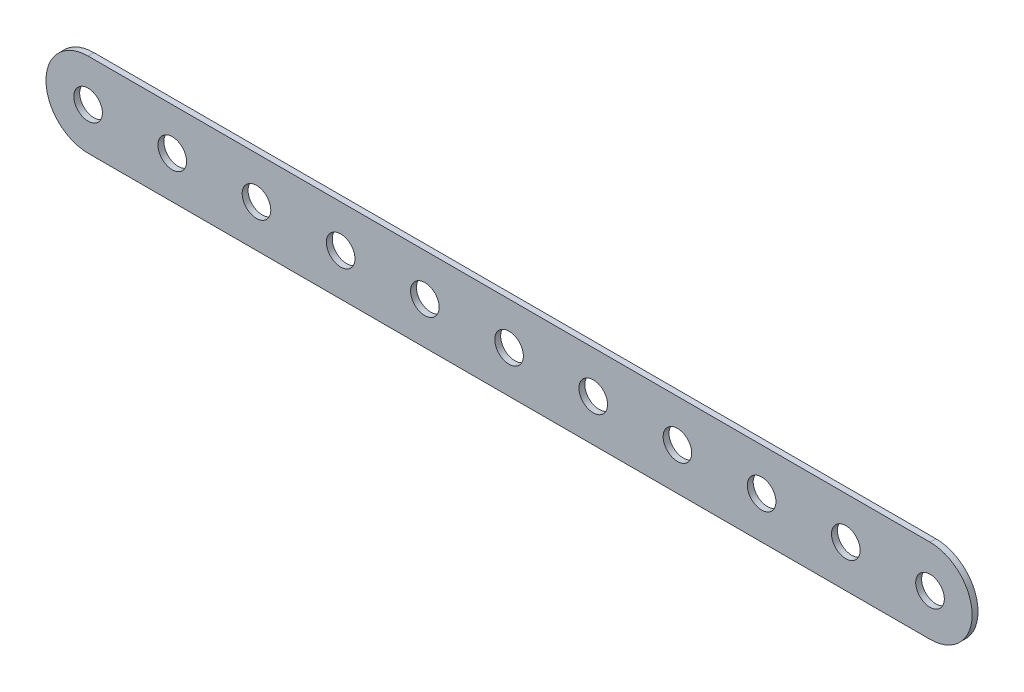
ISO-10303-21;
HEADER;
FILE_DESCRIPTION(('STEP AP214'),'2;1');
FILE_NAME('part.step','',(''),(''),'','','');
FILE_SCHEMA(('AUTOMOTIVE_DESIGN { 1 0 10303 214 1 1 1 1 }'));
ENDSEC;
DATA;
#1=APPLICATION_CONTEXT('core data for automotive mechanical design processes');
#2=APPLICATION_PROTOCOL_DEFINITION('international standard','automotive_design',2000,#1);
#3=PRODUCT_CONTEXT('',#1,'mechanical');
#4=PRODUCT('Part','Part','',(#3));
#5=PRODUCT_RELATED_PRODUCT_CATEGORY('part','',(#4));
#6=PRODUCT_DEFINITION_FORMATION('','',#4);
#7=PRODUCT_DEFINITION_CONTEXT('part definition',#1,'design');
#8=PRODUCT_DEFINITION('design','',#6,#7);
#9=PRODUCT_DEFINITION_SHAPE('','',#8);
#10=(LENGTH_UNIT() NAMED_UNIT(*) SI_UNIT(.MILLI.,.METRE.));
#11=(NAMED_UNIT(*) PLANE_ANGLE_UNIT() SI_UNIT($,.RADIAN.));
#12=(NAMED_UNIT(*) SI_UNIT($,.STERADIAN.) SOLID_ANGLE_UNIT());
#13=UNCERTAINTY_MEASURE_WITH_UNIT(LENGTH_MEASURE(1.E-05),#10,'distance_accuracy_value','');
#14=(GEOMETRIC_REPRESENTATION_CONTEXT(3) GLOBAL_UNCERTAINTY_ASSIGNED_CONTEXT((#13)) GLOBAL_UNIT_ASSIGNED_CONTEXT((#10,
#11,#12)) REPRESENTATION_CONTEXT('',''));
#15=CARTESIAN_POINT('',(0.,0.,0.));
#16=DIRECTION('',(0.,0.,1.));
#17=DIRECTION('',(1.,0.,0.));
#18=AXIS2_PLACEMENT_3D('',#15,#16,#17);
#19=CARTESIAN_POINT('',(-63.5,0.,0.889));
#20=DIRECTION('',(0.,0.,-1.));
#21=DIRECTION('',(-1.,0.,0.));
#22=AXIS2_PLACEMENT_3D('',#19,#20,#21);
#23=CYLINDRICAL_SURFACE('',#22,6.35000000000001);
#24=CARTESIAN_POINT('',(-63.5,0.,0.));
#25=DIRECTION('',(0.,0.,1.));
#26=DIRECTION('',(1.,0.,0.));
#27=AXIS2_PLACEMENT_3D('',#24,#25,#26);
#28=CIRCLE('',#27,6.35000000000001);
#29=CARTESIAN_POINT('',(-63.5,6.35000000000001,0.));
#30=VERTEX_POINT('',#29);
#31=CARTESIAN_POINT('',(-63.5,-6.35000000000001,0.));
#32=VERTEX_POINT('',#31);
#33=EDGE_CURVE('E96',#30,#32,#28,.T.);
#34=ORIENTED_EDGE('',*,*,#33,.T.);
#35=DIRECTION('',(0.,0.,-1.));
#36=VECTOR('',#35,1.);
#37=CARTESIAN_POINT('',(-63.5,-6.35000000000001,0.889));
#38=LINE('',#37,#36);
#39=CARTESIAN_POINT('',(-63.5,-6.35000000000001,0.889));
#40=VERTEX_POINT('',#39);
#41=EDGE_CURVE('E11',#40,#32,#38,.T.);
#42=ORIENTED_EDGE('',*,*,#41,.F.);
#43=CARTESIAN_POINT('',(-63.5,0.,0.889));
#44=DIRECTION('',(0.,0.,1.));
#45=DIRECTION('',(1.,0.,0.));
#46=AXIS2_PLACEMENT_3D('',#43,#44,#45);
#47=CIRCLE('',#46,6.35000000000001);
#48=CARTESIAN_POINT('',(-63.5,6.35000000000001,0.889));
#49=VERTEX_POINT('',#48);
#50=EDGE_CURVE('E84',#49,#40,#47,.T.);
#51=ORIENTED_EDGE('',*,*,#50,.F.);
#52=DIRECTION('',(0.,0.,-1.));
#53=VECTOR('',#52,1.);
#54=CARTESIAN_POINT('',(-63.5,6.35000000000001,0.889));
#55=LINE('',#54,#53);
#56=EDGE_CURVE('E92',#49,#30,#55,.T.);
#57=ORIENTED_EDGE('',*,*,#56,.T.);
#58=EDGE_LOOP('',(#34,#42,#51,#57));
#59=FACE_BOUND('',#58,.T.);
#60=ADVANCED_FACE('F33',(#59),#23,.T.);
#61=CARTESIAN_POINT('',(-63.5,-6.35000000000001,0.889));
#62=DIRECTION('',(0.,1.,0.));
#63=DIRECTION('',(0.,0.,1.));
#64=AXIS2_PLACEMENT_3D('',#61,#62,#63);
#65=PLANE('',#64);
#66=DIRECTION('',(1.,0.,0.));
#67=VECTOR('',#66,1.);
#68=CARTESIAN_POINT('',(-63.5,-6.35000000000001,0.));
#69=LINE('',#68,#67);
#70=CARTESIAN_POINT('',(63.5,-6.35,0.));
#71=VERTEX_POINT('',#70);
#72=EDGE_CURVE('E88',#32,#71,#69,.T.);
#73=ORIENTED_EDGE('',*,*,#72,.T.);
#74=DIRECTION('',(0.,0.,-1.));
#75=VECTOR('',#74,1.);
#76=CARTESIAN_POINT('',(63.5,-6.35,0.889));
#77=LINE('',#76,#75);
#78=CARTESIAN_POINT('',(63.5,-6.35,0.889));
#79=VERTEX_POINT('',#78);
#80=EDGE_CURVE('E41',#79,#71,#77,.T.);
#81=ORIENTED_EDGE('',*,*,#80,.F.);
#82=DIRECTION('',(1.,0.,0.));
#83=VECTOR('',#82,1.);
#84=CARTESIAN_POINT('',(-63.5,-6.35000000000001,0.889));
#85=LINE('',#84,#83);
#86=EDGE_CURVE('E79',#40,#79,#85,.T.);
#87=ORIENTED_EDGE('',*,*,#86,.F.);
#88=ORIENTED_EDGE('',*,*,#41,.T.);
#89=EDGE_LOOP('',(#73,#81,#87,#88));
#90=FACE_BOUND('',#89,.T.);
#91=ADVANCED_FACE('F87',(#90),#65,.F.);
#92=CARTESIAN_POINT('',(63.5,0.,0.889));
#93=DIRECTION('',(0.,0.,-1.));
#94=DIRECTION('',(-1.,0.,0.));
#95=AXIS2_PLACEMENT_3D('',#92,#93,#94);
#96=CYLINDRICAL_SURFACE('',#95,6.35000000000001);
#97=CARTESIAN_POINT('',(63.5,0.,0.));
#98=DIRECTION('',(0.,0.,1.));
#99=DIRECTION('',(1.,0.,0.));
#100=AXIS2_PLACEMENT_3D('',#97,#98,#99);
#101=CIRCLE('',#100,6.35000000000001);
#102=CARTESIAN_POINT('',(63.5,6.35000000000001,0.));
#103=VERTEX_POINT('',#102);
#104=EDGE_CURVE('E66',#71,#103,#101,.T.);
#105=ORIENTED_EDGE('',*,*,#104,.T.);
#106=DIRECTION('',(0.,0.,-1.));
#107=VECTOR('',#106,1.);
#108=CARTESIAN_POINT('',(63.5,6.35000000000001,0.889));
#109=LINE('',#108,#107);
#110=CARTESIAN_POINT('',(63.5,6.35000000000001,0.889));
#111=VERTEX_POINT('',#110);
#112=EDGE_CURVE('E89',#111,#103,#109,.T.);
#113=ORIENTED_EDGE('',*,*,#112,.F.);
#114=CARTESIAN_POINT('',(63.5,0.,0.889));
#115=DIRECTION('',(0.,0.,1.));
#116=DIRECTION('',(1.,0.,0.));
#117=AXIS2_PLACEMENT_3D('',#114,#115,#116);
#118=CIRCLE('',#117,6.35000000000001);
#119=EDGE_CURVE('E82',#79,#111,#118,.T.);
#120=ORIENTED_EDGE('',*,*,#119,.F.);
#121=ORIENTED_EDGE('',*,*,#80,.T.);
#122=EDGE_LOOP('',(#105,#113,#120,#121));
#123=FACE_BOUND('',#122,.T.);
#124=ADVANCED_FACE('F90',(#123),#96,.T.);
#125=CARTESIAN_POINT('',(-63.5,6.35000000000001,0.889));
#126=DIRECTION('',(0.,-1.,0.));
#127=DIRECTION('',(0.,0.,-1.));
#128=AXIS2_PLACEMENT_3D('',#125,#126,#127);
#129=PLANE('',#128);
#130=DIRECTION('',(-1.,0.,0.));
#131=VECTOR('',#130,1.);
#132=CARTESIAN_POINT('',(-63.5,6.35000000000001,0.));
#133=LINE('',#132,#131);
#134=EDGE_CURVE('E72',#103,#30,#133,.T.);
#135=ORIENTED_EDGE('',*,*,#134,.T.);
#136=ORIENTED_EDGE('',*,*,#56,.F.);
#137=DIRECTION('',(-1.,0.,0.));
#138=VECTOR('',#137,1.);
#139=CARTESIAN_POINT('',(-63.5,6.35000000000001,0.889));
#140=LINE('',#139,#138);
#141=EDGE_CURVE('E49',#111,#49,#140,.T.);
#142=ORIENTED_EDGE('',*,*,#141,.F.);
#143=ORIENTED_EDGE('',*,*,#112,.T.);
#144=EDGE_LOOP('',(#135,#136,#142,#143));
#145=FACE_BOUND('',#144,.T.);
#146=ADVANCED_FACE('F104',(#145),#129,.F.);
#147=CARTESIAN_POINT('',(-63.5,0.,0.889));
#148=DIRECTION('',(0.,0.,1.));
#149=DIRECTION('',(1.,0.,0.));
#150=AXIS2_PLACEMENT_3D('',#147,#148,#149);
#151=PLANE('',#150);
#152=CARTESIAN_POINT('',(-63.5,0.,0.889));
#153=DIRECTION('',(0.,0.,1.));
#154=DIRECTION('',(1.,0.,0.));
#155=AXIS2_PLACEMENT_3D('',#152,#153,#154);
#156=CIRCLE('',#155,2.159);
#157=CARTESIAN_POINT('',(-61.341,0.,0.889));
#158=VERTEX_POINT('',#157);
#159=EDGE_CURVE('E170',#158,#158,#156,.T.);
#160=ORIENTED_EDGE('',*,*,#159,.F.);
#161=EDGE_LOOP('',(#160));
#162=FACE_BOUND('',#161,.T.);
#163=CARTESIAN_POINT('',(-50.8,0.,0.889));
#164=DIRECTION('',(0.,0.,1.));
#165=DIRECTION('',(1.,0.,0.));
#166=AXIS2_PLACEMENT_3D('',#163,#164,#165);
#167=CIRCLE('',#166,2.15899999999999);
#168=CARTESIAN_POINT('',(-48.641,0.,0.889));
#169=VERTEX_POINT('',#168);
#170=EDGE_CURVE('E164',#169,#169,#167,.T.);
#171=ORIENTED_EDGE('',*,*,#170,.F.);
#172=EDGE_LOOP('',(#171));
#173=FACE_BOUND('',#172,.T.);
#174=CARTESIAN_POINT('',(-38.1,0.,0.889));
#175=DIRECTION('',(0.,0.,1.));
#176=DIRECTION('',(1.,0.,0.));
#177=AXIS2_PLACEMENT_3D('',#174,#175,#176);
#178=CIRCLE('',#177,2.159);
#179=CARTESIAN_POINT('',(-35.941,0.,0.889));
#180=VERTEX_POINT('',#179);
#181=EDGE_CURVE('E158',#180,#180,#178,.T.);
#182=ORIENTED_EDGE('',*,*,#181,.F.);
#183=EDGE_LOOP('',(#182));
#184=FACE_BOUND('',#183,.T.);
#185=CARTESIAN_POINT('',(-25.4,0.,0.889));
#186=DIRECTION('',(0.,0.,1.));
#187=DIRECTION('',(1.,0.,0.));
#188=AXIS2_PLACEMENT_3D('',#185,#186,#187);
#189=CIRCLE('',#188,2.159);
#190=CARTESIAN_POINT('',(-23.241,0.,0.889));
#191=VERTEX_POINT('',#190);
#192=EDGE_CURVE('E152',#191,#191,#189,.T.);
#193=ORIENTED_EDGE('',*,*,#192,.F.);
#194=EDGE_LOOP('',(#193));
#195=FACE_BOUND('',#194,.T.);
#196=CARTESIAN_POINT('',(-12.7,0.,0.889));
#197=DIRECTION('',(0.,0.,1.));
#198=DIRECTION('',(1.,0.,0.));
#199=AXIS2_PLACEMENT_3D('',#196,#197,#198);
#200=CIRCLE('',#199,2.159);
#201=CARTESIAN_POINT('',(-10.541,0.,0.889));
#202=VERTEX_POINT('',#201);
#203=EDGE_CURVE('E146',#202,#202,#200,.T.);
#204=ORIENTED_EDGE('',*,*,#203,.F.);
#205=EDGE_LOOP('',(#204));
#206=FACE_BOUND('',#205,.T.);
#207=CARTESIAN_POINT('',(0.,0.,0.889));
#208=DIRECTION('',(0.,0.,1.));
#209=DIRECTION('',(1.,0.,0.));
#210=AXIS2_PLACEMENT_3D('',#207,#208,#209);
#211=CIRCLE('',#210,2.159);
#212=CARTESIAN_POINT('',(2.159,0.,0.889));
#213=VERTEX_POINT('',#212);
#214=EDGE_CURVE('E140',#213,#213,#211,.T.);
#215=ORIENTED_EDGE('',*,*,#214,.F.);
#216=EDGE_LOOP('',(#215));
#217=FACE_BOUND('',#216,.T.);
#218=CARTESIAN_POINT('',(12.7,0.,0.889));
#219=DIRECTION('',(0.,0.,1.));
#220=DIRECTION('',(1.,0.,0.));
#221=AXIS2_PLACEMENT_3D('',#218,#219,#220);
#222=CIRCLE('',#221,2.159);
#223=CARTESIAN_POINT('',(14.859,0.,0.889));
#224=VERTEX_POINT('',#223);
#225=EDGE_CURVE('E134',#224,#224,#222,.T.);
#226=ORIENTED_EDGE('',*,*,#225,.F.);
#227=EDGE_LOOP('',(#226));
#228=FACE_BOUND('',#227,.T.);
#229=CARTESIAN_POINT('',(25.4,0.,0.889));
#230=DIRECTION('',(0.,0.,1.));
#231=DIRECTION('',(1.,0.,0.));
#232=AXIS2_PLACEMENT_3D('',#229,#230,#231);
#233=CIRCLE('',#232,2.159);
#234=CARTESIAN_POINT('',(27.559,0.,0.889));
#235=VERTEX_POINT('',#234);
#236=EDGE_CURVE('E128',#235,#235,#233,.T.);
#237=ORIENTED_EDGE('',*,*,#236,.F.);
#238=EDGE_LOOP('',(#237));
#239=FACE_BOUND('',#238,.T.);
#240=CARTESIAN_POINT('',(38.1,0.,0.889));
#241=DIRECTION('',(0.,0.,1.));
#242=DIRECTION('',(1.,0.,0.));
#243=AXIS2_PLACEMENT_3D('',#240,#241,#242);
#244=CIRCLE('',#243,2.159);
#245=CARTESIAN_POINT('',(40.259,0.,0.889));
#246=VERTEX_POINT('',#245);
#247=EDGE_CURVE('E122',#246,#246,#244,.T.);
#248=ORIENTED_EDGE('',*,*,#247,.F.);
#249=EDGE_LOOP('',(#248));
#250=FACE_BOUND('',#249,.T.);
#251=CARTESIAN_POINT('',(50.8,0.,0.889));
#252=DIRECTION('',(0.,0.,1.));
#253=DIRECTION('',(1.,0.,0.));
#254=AXIS2_PLACEMENT_3D('',#251,#252,#253);
#255=CIRCLE('',#254,2.159);
#256=CARTESIAN_POINT('',(52.959,0.,0.889));
#257=VERTEX_POINT('',#256);
#258=EDGE_CURVE('E116',#257,#257,#255,.T.);
#259=ORIENTED_EDGE('',*,*,#258,.F.);
#260=EDGE_LOOP('',(#259));
#261=FACE_BOUND('',#260,.T.);
#262=CARTESIAN_POINT('',(63.5,0.,0.889));
#263=DIRECTION('',(0.,0.,1.));
#264=DIRECTION('',(1.,0.,0.));
#265=AXIS2_PLACEMENT_3D('',#262,#263,#264);
#266=CIRCLE('',#265,2.15899999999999);
#267=CARTESIAN_POINT('',(65.659,0.,0.889));
#268=VERTEX_POINT('',#267);
#269=EDGE_CURVE('E110',#268,#268,#266,.T.);
#270=ORIENTED_EDGE('',*,*,#269,.F.);
#271=EDGE_LOOP('',(#270));
#272=FACE_BOUND('',#271,.T.);
#273=ORIENTED_EDGE('',*,*,#50,.T.);
#274=ORIENTED_EDGE('',*,*,#86,.T.);
#275=ORIENTED_EDGE('',*,*,#119,.T.);
#276=ORIENTED_EDGE('',*,*,#141,.T.);
#277=EDGE_LOOP('',(#273,#274,#275,#276));
#278=FACE_BOUND('',#277,.T.);
#279=ADVANCED_FACE('F80',(#162,#173,#184,#195,#206,#217,#228,#239,#250,#261,#272,#278),#151,.T.);
#280=CARTESIAN_POINT('',(-63.5,0.,0.));
#281=DIRECTION('',(0.,0.,1.));
#282=DIRECTION('',(1.,0.,0.));
#283=AXIS2_PLACEMENT_3D('',#280,#281,#282);
#284=PLANE('',#283);
#285=CARTESIAN_POINT('',(-63.5,0.,0.));
#286=DIRECTION('',(0.,0.,1.));
#287=DIRECTION('',(1.,0.,0.));
#288=AXIS2_PLACEMENT_3D('',#285,#286,#287);
#289=CIRCLE('',#288,2.159);
#290=CARTESIAN_POINT('',(-61.341,0.,0.));
#291=VERTEX_POINT('',#290);
#292=EDGE_CURVE('E99',#291,#291,#289,.T.);
#293=ORIENTED_EDGE('',*,*,#292,.T.);
#294=EDGE_LOOP('',(#293));
#295=FACE_BOUND('',#294,.T.);
#296=CARTESIAN_POINT('',(-50.8,0.,0.));
#297=DIRECTION('',(0.,0.,1.));
#298=DIRECTION('',(1.,0.,0.));
#299=AXIS2_PLACEMENT_3D('',#296,#297,#298);
#300=CIRCLE('',#299,2.15899999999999);
#301=CARTESIAN_POINT('',(-48.641,0.,0.));
#302=VERTEX_POINT('',#301);
#303=EDGE_CURVE('E167',#302,#302,#300,.T.);
#304=ORIENTED_EDGE('',*,*,#303,.T.);
#305=EDGE_LOOP('',(#304));
#306=FACE_BOUND('',#305,.T.);
#307=CARTESIAN_POINT('',(-38.1,0.,0.));
#308=DIRECTION('',(0.,0.,1.));
#309=DIRECTION('',(1.,0.,0.));
#310=AXIS2_PLACEMENT_3D('',#307,#308,#309);
#311=CIRCLE('',#310,2.159);
#312=CARTESIAN_POINT('',(-35.941,0.,0.));
#313=VERTEX_POINT('',#312);
#314=EDGE_CURVE('E161',#313,#313,#311,.T.);
#315=ORIENTED_EDGE('',*,*,#314,.T.);
#316=EDGE_LOOP('',(#315));
#317=FACE_BOUND('',#316,.T.);
#318=CARTESIAN_POINT('',(-25.4,0.,0.));
#319=DIRECTION('',(0.,0.,1.));
#320=DIRECTION('',(1.,0.,0.));
#321=AXIS2_PLACEMENT_3D('',#318,#319,#320);
#322=CIRCLE('',#321,2.159);
#323=CARTESIAN_POINT('',(-23.241,0.,0.));
#324=VERTEX_POINT('',#323);
#325=EDGE_CURVE('E155',#324,#324,#322,.T.);
#326=ORIENTED_EDGE('',*,*,#325,.T.);
#327=EDGE_LOOP('',(#326));
#328=FACE_BOUND('',#327,.T.);
#329=CARTESIAN_POINT('',(-12.7,0.,0.));
#330=DIRECTION('',(0.,0.,1.));
#331=DIRECTION('',(1.,0.,0.));
#332=AXIS2_PLACEMENT_3D('',#329,#330,#331);
#333=CIRCLE('',#332,2.159);
#334=CARTESIAN_POINT('',(-10.541,0.,0.));
#335=VERTEX_POINT('',#334);
#336=EDGE_CURVE('E149',#335,#335,#333,.T.);
#337=ORIENTED_EDGE('',*,*,#336,.T.);
#338=EDGE_LOOP('',(#337));
#339=FACE_BOUND('',#338,.T.);
#340=CARTESIAN_POINT('',(0.,0.,0.));
#341=DIRECTION('',(0.,0.,1.));
#342=DIRECTION('',(1.,0.,0.));
#343=AXIS2_PLACEMENT_3D('',#340,#341,#342);
#344=CIRCLE('',#343,2.159);
#345=CARTESIAN_POINT('',(2.159,0.,0.));
#346=VERTEX_POINT('',#345);
#347=EDGE_CURVE('E143',#346,#346,#344,.T.);
#348=ORIENTED_EDGE('',*,*,#347,.T.);
#349=EDGE_LOOP('',(#348));
#350=FACE_BOUND('',#349,.T.);
#351=CARTESIAN_POINT('',(12.7,0.,0.));
#352=DIRECTION('',(0.,0.,1.));
#353=DIRECTION('',(1.,0.,0.));
#354=AXIS2_PLACEMENT_3D('',#351,#352,#353);
#355=CIRCLE('',#354,2.159);
#356=CARTESIAN_POINT('',(14.859,0.,0.));
#357=VERTEX_POINT('',#356);
#358=EDGE_CURVE('E137',#357,#357,#355,.T.);
#359=ORIENTED_EDGE('',*,*,#358,.T.);
#360=EDGE_LOOP('',(#359));
#361=FACE_BOUND('',#360,.T.);
#362=CARTESIAN_POINT('',(25.4,0.,0.));
#363=DIRECTION('',(0.,0.,1.));
#364=DIRECTION('',(1.,0.,0.));
#365=AXIS2_PLACEMENT_3D('',#362,#363,#364);
#366=CIRCLE('',#365,2.159);
#367=CARTESIAN_POINT('',(27.559,0.,0.));
#368=VERTEX_POINT('',#367);
#369=EDGE_CURVE('E131',#368,#368,#366,.T.);
#370=ORIENTED_EDGE('',*,*,#369,.T.);
#371=EDGE_LOOP('',(#370));
#372=FACE_BOUND('',#371,.T.);
#373=CARTESIAN_POINT('',(38.1,0.,0.));
#374=DIRECTION('',(0.,0.,1.));
#375=DIRECTION('',(1.,0.,0.));
#376=AXIS2_PLACEMENT_3D('',#373,#374,#375);
#377=CIRCLE('',#376,2.159);
#378=CARTESIAN_POINT('',(40.259,0.,0.));
#379=VERTEX_POINT('',#378);
#380=EDGE_CURVE('E125',#379,#379,#377,.T.);
#381=ORIENTED_EDGE('',*,*,#380,.T.);
#382=EDGE_LOOP('',(#381));
#383=FACE_BOUND('',#382,.T.);
#384=CARTESIAN_POINT('',(50.8,0.,0.));
#385=DIRECTION('',(0.,0.,1.));
#386=DIRECTION('',(1.,0.,0.));
#387=AXIS2_PLACEMENT_3D('',#384,#385,#386);
#388=CIRCLE('',#387,2.159);
#389=CARTESIAN_POINT('',(52.959,0.,0.));
#390=VERTEX_POINT('',#389);
#391=EDGE_CURVE('E119',#390,#390,#388,.T.);
#392=ORIENTED_EDGE('',*,*,#391,.T.);
#393=EDGE_LOOP('',(#392));
#394=FACE_BOUND('',#393,.T.);
#395=CARTESIAN_POINT('',(63.5,0.,0.));
#396=DIRECTION('',(0.,0.,1.));
#397=DIRECTION('',(1.,0.,0.));
#398=AXIS2_PLACEMENT_3D('',#395,#396,#397);
#399=CIRCLE('',#398,2.15899999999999);
#400=CARTESIAN_POINT('',(65.659,0.,0.));
#401=VERTEX_POINT('',#400);
#402=EDGE_CURVE('E113',#401,#401,#399,.T.);
#403=ORIENTED_EDGE('',*,*,#402,.T.);
#404=EDGE_LOOP('',(#403));
#405=FACE_BOUND('',#404,.T.);
#406=ORIENTED_EDGE('',*,*,#33,.F.);
#407=ORIENTED_EDGE('',*,*,#134,.F.);
#408=ORIENTED_EDGE('',*,*,#104,.F.);
#409=ORIENTED_EDGE('',*,*,#72,.F.);
#410=EDGE_LOOP('',(#406,#407,#408,#409));
#411=FACE_BOUND('',#410,.T.);
#412=ADVANCED_FACE('F107',(#295,#306,#317,#328,#339,#350,#361,#372,#383,#394,#405,#411),#284,.F.);
#413=CARTESIAN_POINT('',(63.5,0.,0.));
#414=DIRECTION('',(0.,0.,1.));
#415=DIRECTION('',(1.,0.,0.));
#416=AXIS2_PLACEMENT_3D('',#413,#414,#415);
#417=CYLINDRICAL_SURFACE('',#416,2.15899999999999);
#418=ORIENTED_EDGE('',*,*,#402,.F.);
#419=EDGE_LOOP('',(#418));
#420=FACE_BOUND('',#419,.T.);
#421=ORIENTED_EDGE('',*,*,#269,.T.);
#422=EDGE_LOOP('',(#421));
#423=FACE_BOUND('',#422,.T.);
#424=ADVANCED_FACE('F208',(#420,#423),#417,.F.);
#425=CARTESIAN_POINT('',(50.8,0.,0.));
#426=DIRECTION('',(0.,0.,1.));
#427=DIRECTION('',(1.,0.,0.));
#428=AXIS2_PLACEMENT_3D('',#425,#426,#427);
#429=CYLINDRICAL_SURFACE('',#428,2.159);
#430=ORIENTED_EDGE('',*,*,#391,.F.);
#431=EDGE_LOOP('',(#430));
#432=FACE_BOUND('',#431,.T.);
#433=ORIENTED_EDGE('',*,*,#258,.T.);
#434=EDGE_LOOP('',(#433));
#435=FACE_BOUND('',#434,.T.);
#436=ADVANCED_FACE('F210',(#432,#435),#429,.F.);
#437=CARTESIAN_POINT('',(38.1,0.,0.));
#438=DIRECTION('',(0.,0.,1.));
#439=DIRECTION('',(1.,0.,0.));
#440=AXIS2_PLACEMENT_3D('',#437,#438,#439);
#441=CYLINDRICAL_SURFACE('',#440,2.159);
#442=ORIENTED_EDGE('',*,*,#380,.F.);
#443=EDGE_LOOP('',(#442));
#444=FACE_BOUND('',#443,.T.);
#445=ORIENTED_EDGE('',*,*,#247,.T.);
#446=EDGE_LOOP('',(#445));
#447=FACE_BOUND('',#446,.T.);
#448=ADVANCED_FACE('F217',(#444,#447),#441,.F.);
#449=CARTESIAN_POINT('',(25.4,0.,0.));
#450=DIRECTION('',(0.,0.,1.));
#451=DIRECTION('',(1.,0.,0.));
#452=AXIS2_PLACEMENT_3D('',#449,#450,#451);
#453=CYLINDRICAL_SURFACE('',#452,2.159);
#454=ORIENTED_EDGE('',*,*,#369,.F.);
#455=EDGE_LOOP('',(#454));
#456=FACE_BOUND('',#455,.T.);
#457=ORIENTED_EDGE('',*,*,#236,.T.);
#458=EDGE_LOOP('',(#457));
#459=FACE_BOUND('',#458,.T.);
#460=ADVANCED_FACE('F263',(#456,#459),#453,.F.);
#461=CARTESIAN_POINT('',(12.7,0.,0.));
#462=DIRECTION('',(0.,0.,1.));
#463=DIRECTION('',(1.,0.,0.));
#464=AXIS2_PLACEMENT_3D('',#461,#462,#463);
#465=CYLINDRICAL_SURFACE('',#464,2.159);
#466=ORIENTED_EDGE('',*,*,#358,.F.);
#467=EDGE_LOOP('',(#466));
#468=FACE_BOUND('',#467,.T.);
#469=ORIENTED_EDGE('',*,*,#225,.T.);
#470=EDGE_LOOP('',(#469));
#471=FACE_BOUND('',#470,.T.);
#472=ADVANCED_FACE('F273',(#468,#471),#465,.F.);
#473=CARTESIAN_POINT('',(0.,0.,0.));
#474=DIRECTION('',(0.,0.,1.));
#475=DIRECTION('',(1.,0.,0.));
#476=AXIS2_PLACEMENT_3D('',#473,#474,#475);
#477=CYLINDRICAL_SURFACE('',#476,2.159);
#478=ORIENTED_EDGE('',*,*,#347,.F.);
#479=EDGE_LOOP('',(#478));
#480=FACE_BOUND('',#479,.T.);
#481=ORIENTED_EDGE('',*,*,#214,.T.);
#482=EDGE_LOOP('',(#481));
#483=FACE_BOUND('',#482,.T.);
#484=ADVANCED_FACE('F283',(#480,#483),#477,.F.);
#485=CARTESIAN_POINT('',(-12.7,0.,0.));
#486=DIRECTION('',(0.,0.,1.));
#487=DIRECTION('',(1.,0.,0.));
#488=AXIS2_PLACEMENT_3D('',#485,#486,#487);
#489=CYLINDRICAL_SURFACE('',#488,2.159);
#490=ORIENTED_EDGE('',*,*,#336,.F.);
#491=EDGE_LOOP('',(#490));
#492=FACE_BOUND('',#491,.T.);
#493=ORIENTED_EDGE('',*,*,#203,.T.);
#494=EDGE_LOOP('',(#493));
#495=FACE_BOUND('',#494,.T.);
#496=ADVANCED_FACE('F293',(#492,#495),#489,.F.);
#497=CARTESIAN_POINT('',(-25.4,0.,0.));
#498=DIRECTION('',(0.,0.,1.));
#499=DIRECTION('',(1.,0.,0.));
#500=AXIS2_PLACEMENT_3D('',#497,#498,#499);
#501=CYLINDRICAL_SURFACE('',#500,2.159);
#502=ORIENTED_EDGE('',*,*,#325,.F.);
#503=EDGE_LOOP('',(#502));
#504=FACE_BOUND('',#503,.T.);
#505=ORIENTED_EDGE('',*,*,#192,.T.);
#506=EDGE_LOOP('',(#505));
#507=FACE_BOUND('',#506,.T.);
#508=ADVANCED_FACE('F303',(#504,#507),#501,.F.);
#509=CARTESIAN_POINT('',(-38.1,0.,0.));
#510=DIRECTION('',(0.,0.,1.));
#511=DIRECTION('',(1.,0.,0.));
#512=AXIS2_PLACEMENT_3D('',#509,#510,#511);
#513=CYLINDRICAL_SURFACE('',#512,2.159);
#514=ORIENTED_EDGE('',*,*,#314,.F.);
#515=EDGE_LOOP('',(#514));
#516=FACE_BOUND('',#515,.T.);
#517=ORIENTED_EDGE('',*,*,#181,.T.);
#518=EDGE_LOOP('',(#517));
#519=FACE_BOUND('',#518,.T.);
#520=ADVANCED_FACE('F313',(#516,#519),#513,.F.);
#521=CARTESIAN_POINT('',(-50.8,0.,0.));
#522=DIRECTION('',(0.,0.,1.));
#523=DIRECTION('',(1.,0.,0.));
#524=AXIS2_PLACEMENT_3D('',#521,#522,#523);
#525=CYLINDRICAL_SURFACE('',#524,2.15899999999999);
#526=ORIENTED_EDGE('',*,*,#303,.F.);
#527=EDGE_LOOP('',(#526));
#528=FACE_BOUND('',#527,.T.);
#529=ORIENTED_EDGE('',*,*,#170,.T.);
#530=EDGE_LOOP('',(#529));
#531=FACE_BOUND('',#530,.T.);
#532=ADVANCED_FACE('F181',(#528,#531),#525,.F.);
#533=CARTESIAN_POINT('',(-63.5,0.,0.));
#534=DIRECTION('',(0.,0.,1.));
#535=DIRECTION('',(1.,0.,0.));
#536=AXIS2_PLACEMENT_3D('',#533,#534,#535);
#537=CYLINDRICAL_SURFACE('',#536,2.159);
#538=ORIENTED_EDGE('',*,*,#292,.F.);
#539=EDGE_LOOP('',(#538));
#540=FACE_BOUND('',#539,.T.);
#541=ORIENTED_EDGE('',*,*,#159,.T.);
#542=EDGE_LOOP('',(#541));
#543=FACE_BOUND('',#542,.T.);
#544=ADVANCED_FACE('F178',(#540,#543),#537,.F.);
#545=CLOSED_SHELL('',(#60,#91,#124,#146,#279,#412,#424,#436,#448,#460,#472,#484,#496,#508,#520,
#532,#544));
#546=MANIFOLD_SOLID_BREP('B2',#545);
#547=ADVANCED_BREP_SHAPE_REPRESENTATION('',(#18,#546),#14);
#548=SHAPE_DEFINITION_REPRESENTATION(#9,#547);
ENDSEC;
END-ISO-10303-21;
